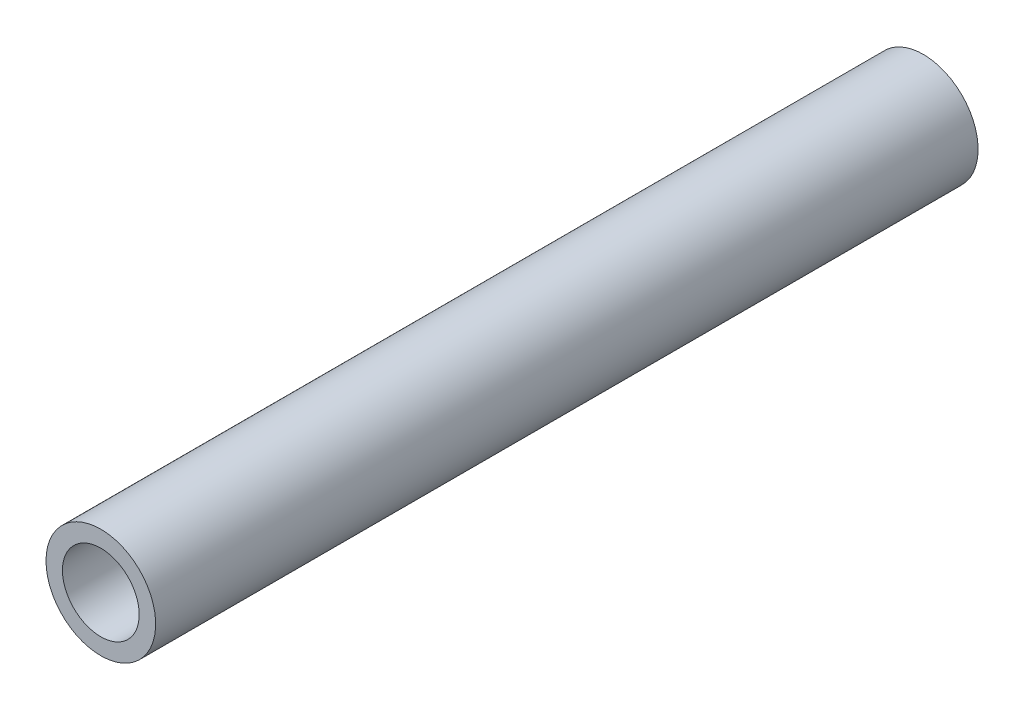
from build123d import *

# Parameters (mm, degrees)
EXTRUDE1_DEPTH      = 22.5
EXTRUDE1_DEPTH_BACK = 22.5
SKETCH1_R           = 3
SKETCH1_R_2         = 2.1


with BuildPart() as part:
    # Sketch1 → Extrude1 (new, two sides: drawn at the far end of the back side and taken through both)
    with BuildSketch(Plane.XY.offset(-EXTRUDE1_DEPTH_BACK)):
        with Locations(Location((0, 0, 0), (0, 0, 180))):
            Circle(SKETCH1_R)
        with Locations(Location((0, 0, 0), (0, 0, 180))):
            Circle(SKETCH1_R_2, mode=Mode.SUBTRACT)
    extrude(amount=EXTRUDE1_DEPTH + EXTRUDE1_DEPTH_BACK)


solid = part.part
